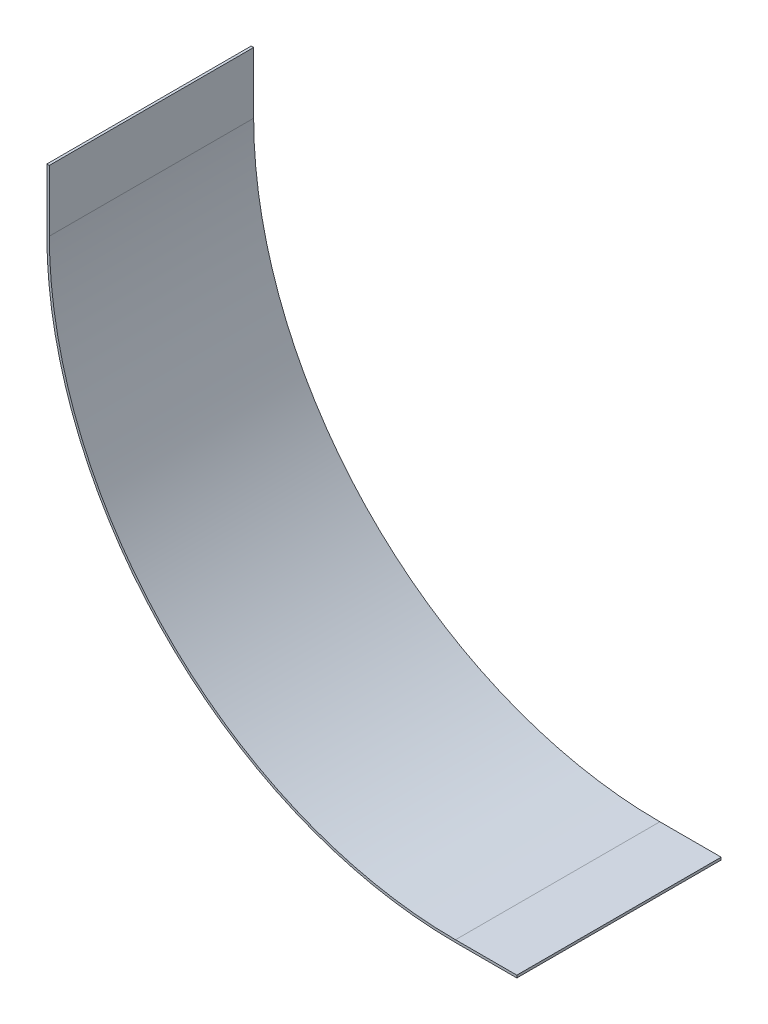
from build123d import *

# Parameters (mm, degrees)
EXTRUDE_THIN1_DEPTH = 100


with BuildPart() as part:
    # Sketch1 → Extrude-Thin1 (new body)
    with BuildSketch(Plane.XY):
        with BuildLine():
            Line((230, -230), (200, -230))
            ThreePointArc((200, -230), (58.578643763, -171.421356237), (0, -30))
            Line((0, -30), (0, 0))
            Line((0, 0), (1.214, 0))
            Line((1.214, 0), (1.214, -30))
            ThreePointArc((1.214, -30), (59.437071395, -170.562928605), (200, -228.786))
            Line((200, -228.786), (230, -228.786))
            Line((230, -228.786), (230, -230))
        make_face()
    extrude(amount=EXTRUDE_THIN1_DEPTH)


solid = part.part
